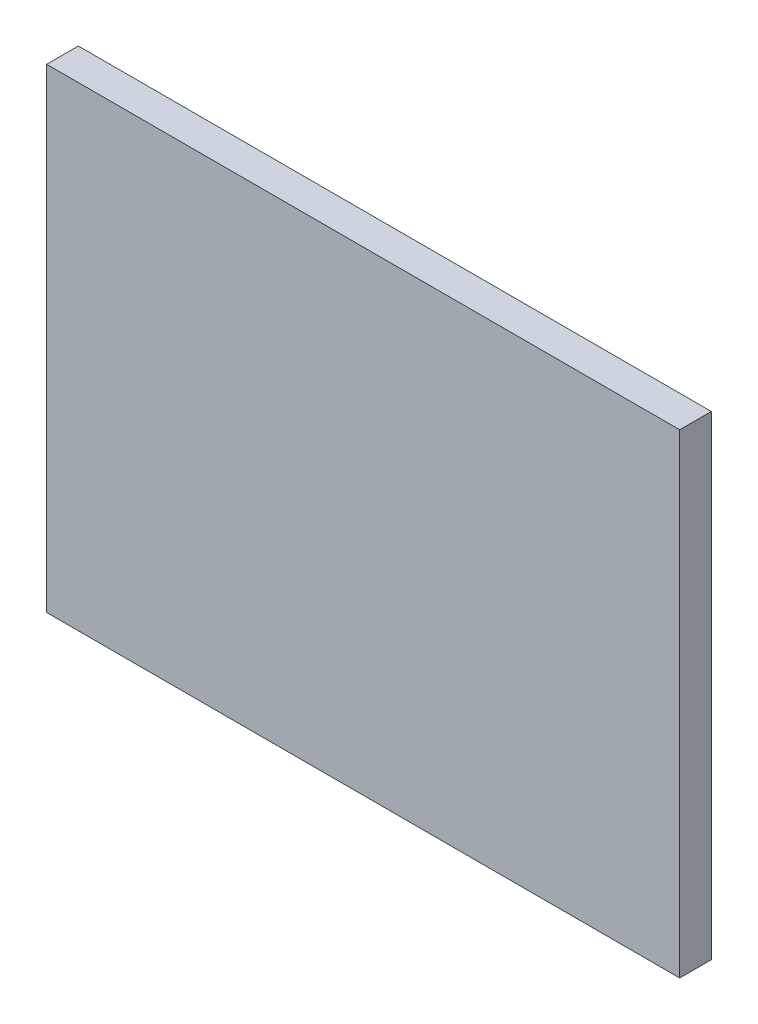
from build123d import *

# Parameters (mm, degrees)
SKIZZE1_W               = 100
SKIZZE1_H               = 75
LINEAR_AUSTRAGEN1_DEPTH = 5


with BuildPart() as part:
    # Skizze1 → Linear austragen1 (new body)
    with BuildSketch(Plane.XY):
        with Locations((50, -37.5)):
            Rectangle(SKIZZE1_W, SKIZZE1_H)
    extrude(amount=LINEAR_AUSTRAGEN1_DEPTH)


solid = part.part
